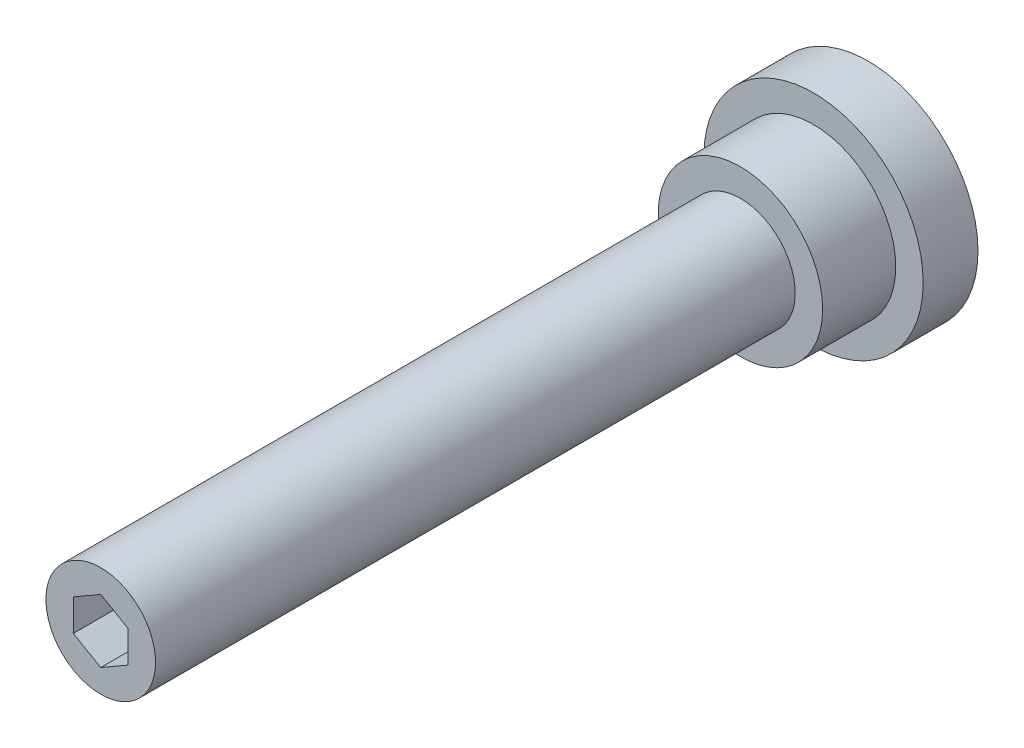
ISO-10303-21;
HEADER;
FILE_DESCRIPTION(('STEP AP214'),'2;1');
FILE_NAME('part.step','',(''),(''),'','','');
FILE_SCHEMA(('AUTOMOTIVE_DESIGN { 1 0 10303 214 1 1 1 1 }'));
ENDSEC;
DATA;
#1=APPLICATION_CONTEXT('core data for automotive mechanical design processes');
#2=APPLICATION_PROTOCOL_DEFINITION('international standard','automotive_design',2000,#1);
#3=PRODUCT_CONTEXT('',#1,'mechanical');
#4=PRODUCT('Part','Part','',(#3));
#5=PRODUCT_RELATED_PRODUCT_CATEGORY('part','',(#4));
#6=PRODUCT_DEFINITION_FORMATION('','',#4);
#7=PRODUCT_DEFINITION_CONTEXT('part definition',#1,'design');
#8=PRODUCT_DEFINITION('design','',#6,#7);
#9=PRODUCT_DEFINITION_SHAPE('','',#8);
#10=(LENGTH_UNIT() NAMED_UNIT(*) SI_UNIT(.MILLI.,.METRE.));
#11=(NAMED_UNIT(*) PLANE_ANGLE_UNIT() SI_UNIT($,.RADIAN.));
#12=(NAMED_UNIT(*) SI_UNIT($,.STERADIAN.) SOLID_ANGLE_UNIT());
#13=UNCERTAINTY_MEASURE_WITH_UNIT(LENGTH_MEASURE(1.E-05),#10,'distance_accuracy_value','');
#14=(GEOMETRIC_REPRESENTATION_CONTEXT(3) GLOBAL_UNCERTAINTY_ASSIGNED_CONTEXT((#13)) GLOBAL_UNIT_ASSIGNED_CONTEXT((#10,
#11,#12)) REPRESENTATION_CONTEXT('',''));
#15=CARTESIAN_POINT('',(0.,0.,0.));
#16=DIRECTION('',(0.,0.,1.));
#17=DIRECTION('',(1.,0.,0.));
#18=AXIS2_PLACEMENT_3D('',#15,#16,#17);
#19=CARTESIAN_POINT('',(0.,0.,42.));
#20=DIRECTION('',(0.,0.,1.));
#21=DIRECTION('',(1.,0.,0.));
#22=AXIS2_PLACEMENT_3D('',#19,#20,#21);
#23=PLANE('',#22);
#24=DIRECTION('',(-0.866025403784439,0.5,0.));
#25=VECTOR('',#24,1.);
#26=CARTESIAN_POINT('',(1.5,0.866025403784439,42.));
#27=LINE('',#26,#25);
#28=CARTESIAN_POINT('',(1.5,0.866025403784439,42.));
#29=VERTEX_POINT('',#28);
#30=CARTESIAN_POINT('',(0.,1.73205080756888,42.));
#31=VERTEX_POINT('',#30);
#32=EDGE_CURVE('E28',#29,#31,#27,.T.);
#33=ORIENTED_EDGE('',*,*,#32,.F.);
#34=DIRECTION('',(0.,1.,0.));
#35=VECTOR('',#34,1.);
#36=CARTESIAN_POINT('',(1.5,-0.866025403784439,42.));
#37=LINE('',#36,#35);
#38=CARTESIAN_POINT('',(1.5,-0.866025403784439,42.));
#39=VERTEX_POINT('',#38);
#40=EDGE_CURVE('E111',#39,#29,#37,.T.);
#41=ORIENTED_EDGE('',*,*,#40,.F.);
#42=DIRECTION('',(0.866025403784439,0.5,0.));
#43=VECTOR('',#42,1.);
#44=CARTESIAN_POINT('',(0.,-1.73205080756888,42.));
#45=LINE('',#44,#43);
#46=CARTESIAN_POINT('',(0.,-1.73205080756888,42.));
#47=VERTEX_POINT('',#46);
#48=EDGE_CURVE('E109',#47,#39,#45,.T.);
#49=ORIENTED_EDGE('',*,*,#48,.F.);
#50=DIRECTION('',(0.866025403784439,-0.5,0.));
#51=VECTOR('',#50,1.);
#52=CARTESIAN_POINT('',(-1.5,-0.866025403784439,42.));
#53=LINE('',#52,#51);
#54=CARTESIAN_POINT('',(-1.5,-0.866025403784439,42.));
#55=VERTEX_POINT('',#54);
#56=EDGE_CURVE('E76',#55,#47,#53,.T.);
#57=ORIENTED_EDGE('',*,*,#56,.F.);
#58=DIRECTION('',(0.,-1.,0.));
#59=VECTOR('',#58,1.);
#60=CARTESIAN_POINT('',(-1.5,0.86602540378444,42.));
#61=LINE('',#60,#59);
#62=CARTESIAN_POINT('',(-1.5,0.86602540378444,42.));
#63=VERTEX_POINT('',#62);
#64=EDGE_CURVE('E105',#63,#55,#61,.T.);
#65=ORIENTED_EDGE('',*,*,#64,.F.);
#66=DIRECTION('',(-0.866025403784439,-0.5,0.));
#67=VECTOR('',#66,1.);
#68=CARTESIAN_POINT('',(0.,1.73205080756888,42.));
#69=LINE('',#68,#67);
#70=EDGE_CURVE('E102',#31,#63,#69,.T.);
#71=ORIENTED_EDGE('',*,*,#70,.F.);
#72=EDGE_LOOP('',(#33,#41,#49,#57,#65,#71));
#73=FACE_BOUND('',#72,.T.);
#74=CARTESIAN_POINT('',(0.,0.,42.));
#75=DIRECTION('',(0.,0.,1.));
#76=DIRECTION('',(1.,0.,0.));
#77=AXIS2_PLACEMENT_3D('',#74,#75,#76);
#78=CIRCLE('',#77,3.);
#79=CARTESIAN_POINT('',(3.,0.,42.));
#80=VERTEX_POINT('',#79);
#81=EDGE_CURVE('E9',#80,#80,#78,.T.);
#82=ORIENTED_EDGE('',*,*,#81,.T.);
#83=EDGE_LOOP('',(#82));
#84=FACE_BOUND('',#83,.T.);
#85=ADVANCED_FACE('F14',(#73,#84),#23,.T.);
#86=CARTESIAN_POINT('',(0.,0.,30.));
#87=DIRECTION('',(0.,0.,1.));
#88=DIRECTION('',(1.,0.,0.));
#89=AXIS2_PLACEMENT_3D('',#86,#87,#88);
#90=CYLINDRICAL_SURFACE('',#89,3.);
#91=CARTESIAN_POINT('',(0.,0.,7.));
#92=DIRECTION('',(0.,0.,1.));
#93=DIRECTION('',(1.,0.,0.));
#94=AXIS2_PLACEMENT_3D('',#91,#92,#93);
#95=CIRCLE('',#94,3.);
#96=CARTESIAN_POINT('',(3.,0.,7.));
#97=VERTEX_POINT('',#96);
#98=EDGE_CURVE('E21',#97,#97,#95,.T.);
#99=ORIENTED_EDGE('',*,*,#98,.T.);
#100=EDGE_LOOP('',(#99));
#101=FACE_BOUND('',#100,.T.);
#102=ORIENTED_EDGE('',*,*,#81,.F.);
#103=EDGE_LOOP('',(#102));
#104=FACE_BOUND('',#103,.T.);
#105=ADVANCED_FACE('F134',(#101,#104),#90,.T.);
#106=CARTESIAN_POINT('',(-3.,0.,7.));
#107=DIRECTION('',(0.,0.,1.));
#108=DIRECTION('',(1.,0.,0.));
#109=AXIS2_PLACEMENT_3D('',#106,#107,#108);
#110=PLANE('',#109);
#111=CARTESIAN_POINT('',(0.,0.,7.));
#112=DIRECTION('',(0.,0.,1.));
#113=DIRECTION('',(1.,0.,0.));
#114=AXIS2_PLACEMENT_3D('',#111,#112,#113);
#115=CIRCLE('',#114,4.5);
#116=CARTESIAN_POINT('',(4.5,0.,7.));
#117=VERTEX_POINT('',#116);
#118=EDGE_CURVE('E129',#117,#117,#115,.T.);
#119=ORIENTED_EDGE('',*,*,#118,.T.);
#120=EDGE_LOOP('',(#119));
#121=FACE_BOUND('',#120,.T.);
#122=ORIENTED_EDGE('',*,*,#98,.F.);
#123=EDGE_LOOP('',(#122));
#124=FACE_BOUND('',#123,.T.);
#125=ADVANCED_FACE('F137',(#121,#124),#110,.T.);
#126=CARTESIAN_POINT('',(0.,0.,30.));
#127=DIRECTION('',(0.,0.,1.));
#128=DIRECTION('',(1.,0.,0.));
#129=AXIS2_PLACEMENT_3D('',#126,#127,#128);
#130=CYLINDRICAL_SURFACE('',#129,4.5);
#131=CARTESIAN_POINT('',(0.,0.,3.));
#132=DIRECTION('',(0.,0.,1.));
#133=DIRECTION('',(1.,0.,0.));
#134=AXIS2_PLACEMENT_3D('',#131,#132,#133);
#135=CIRCLE('',#134,4.5);
#136=CARTESIAN_POINT('',(4.5,0.,3.));
#137=VERTEX_POINT('',#136);
#138=EDGE_CURVE('E126',#137,#137,#135,.T.);
#139=ORIENTED_EDGE('',*,*,#138,.T.);
#140=EDGE_LOOP('',(#139));
#141=FACE_BOUND('',#140,.T.);
#142=ORIENTED_EDGE('',*,*,#118,.F.);
#143=EDGE_LOOP('',(#142));
#144=FACE_BOUND('',#143,.T.);
#145=ADVANCED_FACE('F139',(#141,#144),#130,.T.);
#146=CARTESIAN_POINT('',(-4.5,0.,3.));
#147=DIRECTION('',(0.,0.,1.));
#148=DIRECTION('',(1.,0.,0.));
#149=AXIS2_PLACEMENT_3D('',#146,#147,#148);
#150=PLANE('',#149);
#151=CARTESIAN_POINT('',(0.,0.,3.));
#152=DIRECTION('',(0.,0.,1.));
#153=DIRECTION('',(1.,0.,0.));
#154=AXIS2_PLACEMENT_3D('',#151,#152,#153);
#155=CIRCLE('',#154,6.);
#156=CARTESIAN_POINT('',(6.,0.,3.));
#157=VERTEX_POINT('',#156);
#158=EDGE_CURVE('E123',#157,#157,#155,.T.);
#159=ORIENTED_EDGE('',*,*,#158,.T.);
#160=EDGE_LOOP('',(#159));
#161=FACE_BOUND('',#160,.T.);
#162=ORIENTED_EDGE('',*,*,#138,.F.);
#163=EDGE_LOOP('',(#162));
#164=FACE_BOUND('',#163,.T.);
#165=ADVANCED_FACE('F147',(#161,#164),#150,.T.);
#166=CARTESIAN_POINT('',(0.,0.,30.));
#167=DIRECTION('',(0.,0.,1.));
#168=DIRECTION('',(1.,0.,0.));
#169=AXIS2_PLACEMENT_3D('',#166,#167,#168);
#170=CYLINDRICAL_SURFACE('',#169,6.);
#171=CARTESIAN_POINT('',(0.,0.,0.));
#172=DIRECTION('',(0.,0.,1.));
#173=DIRECTION('',(1.,0.,0.));
#174=AXIS2_PLACEMENT_3D('',#171,#172,#173);
#175=CIRCLE('',#174,6.);
#176=CARTESIAN_POINT('',(6.,0.,0.));
#177=VERTEX_POINT('',#176);
#178=EDGE_CURVE('E115',#177,#177,#175,.T.);
#179=ORIENTED_EDGE('',*,*,#178,.T.);
#180=EDGE_LOOP('',(#179));
#181=FACE_BOUND('',#180,.T.);
#182=ORIENTED_EDGE('',*,*,#158,.F.);
#183=EDGE_LOOP('',(#182));
#184=FACE_BOUND('',#183,.T.);
#185=ADVANCED_FACE('F172',(#181,#184),#170,.T.);
#186=CARTESIAN_POINT('',(-6.,0.,0.));
#187=DIRECTION('',(0.,0.,-1.));
#188=DIRECTION('',(-1.,0.,0.));
#189=AXIS2_PLACEMENT_3D('',#186,#187,#188);
#190=PLANE('',#189);
#191=ORIENTED_EDGE('',*,*,#178,.F.);
#192=EDGE_LOOP('',(#191));
#193=FACE_BOUND('',#192,.T.);
#194=ADVANCED_FACE('F165',(#193),#190,.T.);
#195=CARTESIAN_POINT('',(1.5,0.866025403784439,39.));
#196=DIRECTION('',(0.5,0.866025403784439,0.));
#197=DIRECTION('',(-0.866025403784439,0.5,0.));
#198=AXIS2_PLACEMENT_3D('',#195,#196,#197);
#199=PLANE('',#198);
#200=ORIENTED_EDGE('',*,*,#32,.T.);
#201=DIRECTION('',(0.,0.,1.));
#202=VECTOR('',#201,1.);
#203=CARTESIAN_POINT('',(0.,1.73205080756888,39.));
#204=LINE('',#203,#202);
#205=CARTESIAN_POINT('',(0.,1.73205080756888,39.));
#206=VERTEX_POINT('',#205);
#207=EDGE_CURVE('E58',#206,#31,#204,.T.);
#208=ORIENTED_EDGE('',*,*,#207,.F.);
#209=DIRECTION('',(-0.866025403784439,0.5,0.));
#210=VECTOR('',#209,1.);
#211=CARTESIAN_POINT('',(1.5,0.866025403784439,39.));
#212=LINE('',#211,#210);
#213=CARTESIAN_POINT('',(1.5,0.866025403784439,39.));
#214=VERTEX_POINT('',#213);
#215=EDGE_CURVE('E113',#214,#206,#212,.T.);
#216=ORIENTED_EDGE('',*,*,#215,.F.);
#217=DIRECTION('',(0.,0.,1.));
#218=VECTOR('',#217,1.);
#219=CARTESIAN_POINT('',(1.5,0.866025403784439,39.));
#220=LINE('',#219,#218);
#221=EDGE_CURVE('E36',#214,#29,#220,.T.);
#222=ORIENTED_EDGE('',*,*,#221,.T.);
#223=EDGE_LOOP('',(#200,#208,#216,#222));
#224=FACE_BOUND('',#223,.T.);
#225=ADVANCED_FACE('F162',(#224),#199,.F.);
#226=CARTESIAN_POINT('',(1.5,-0.866025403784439,39.));
#227=DIRECTION('',(1.,0.,0.));
#228=DIRECTION('',(0.,1.,0.));
#229=AXIS2_PLACEMENT_3D('',#226,#227,#228);
#230=PLANE('',#229);
#231=ORIENTED_EDGE('',*,*,#40,.T.);
#232=ORIENTED_EDGE('',*,*,#221,.F.);
#233=DIRECTION('',(0.,1.,0.));
#234=VECTOR('',#233,1.);
#235=CARTESIAN_POINT('',(1.5,-0.866025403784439,39.));
#236=LINE('',#235,#234);
#237=CARTESIAN_POINT('',(1.5,-0.866025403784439,39.));
#238=VERTEX_POINT('',#237);
#239=EDGE_CURVE('E88',#238,#214,#236,.T.);
#240=ORIENTED_EDGE('',*,*,#239,.F.);
#241=DIRECTION('',(0.,0.,1.));
#242=VECTOR('',#241,1.);
#243=CARTESIAN_POINT('',(1.5,-0.866025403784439,39.));
#244=LINE('',#243,#242);
#245=EDGE_CURVE('E80',#238,#39,#244,.T.);
#246=ORIENTED_EDGE('',*,*,#245,.T.);
#247=EDGE_LOOP('',(#231,#232,#240,#246));
#248=FACE_BOUND('',#247,.T.);
#249=ADVANCED_FACE('F164',(#248),#230,.F.);
#250=CARTESIAN_POINT('',(0.,-1.73205080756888,39.));
#251=DIRECTION('',(0.5,-0.866025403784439,0.));
#252=DIRECTION('',(0.866025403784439,0.5,0.));
#253=AXIS2_PLACEMENT_3D('',#250,#251,#252);
#254=PLANE('',#253);
#255=ORIENTED_EDGE('',*,*,#48,.T.);
#256=ORIENTED_EDGE('',*,*,#245,.F.);
#257=DIRECTION('',(0.866025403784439,0.5,0.));
#258=VECTOR('',#257,1.);
#259=CARTESIAN_POINT('',(0.,-1.73205080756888,39.));
#260=LINE('',#259,#258);
#261=CARTESIAN_POINT('',(0.,-1.73205080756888,39.));
#262=VERTEX_POINT('',#261);
#263=EDGE_CURVE('E84',#262,#238,#260,.T.);
#264=ORIENTED_EDGE('',*,*,#263,.F.);
#265=DIRECTION('',(0.,0.,1.));
#266=VECTOR('',#265,1.);
#267=CARTESIAN_POINT('',(0.,-1.73205080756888,39.));
#268=LINE('',#267,#266);
#269=EDGE_CURVE('E69',#262,#47,#268,.T.);
#270=ORIENTED_EDGE('',*,*,#269,.T.);
#271=EDGE_LOOP('',(#255,#256,#264,#270));
#272=FACE_BOUND('',#271,.T.);
#273=ADVANCED_FACE('F85',(#272),#254,.F.);
#274=CARTESIAN_POINT('',(-1.5,-0.866025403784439,39.));
#275=DIRECTION('',(-0.5,-0.866025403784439,0.));
#276=DIRECTION('',(0.866025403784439,-0.5,0.));
#277=AXIS2_PLACEMENT_3D('',#274,#275,#276);
#278=PLANE('',#277);
#279=ORIENTED_EDGE('',*,*,#56,.T.);
#280=ORIENTED_EDGE('',*,*,#269,.F.);
#281=DIRECTION('',(0.866025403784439,-0.5,0.));
#282=VECTOR('',#281,1.);
#283=CARTESIAN_POINT('',(-1.5,-0.866025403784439,39.));
#284=LINE('',#283,#282);
#285=CARTESIAN_POINT('',(-1.5,-0.866025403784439,39.));
#286=VERTEX_POINT('',#285);
#287=EDGE_CURVE('E73',#286,#262,#284,.T.);
#288=ORIENTED_EDGE('',*,*,#287,.F.);
#289=DIRECTION('',(0.,0.,1.));
#290=VECTOR('',#289,1.);
#291=CARTESIAN_POINT('',(-1.5,-0.866025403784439,39.));
#292=LINE('',#291,#290);
#293=EDGE_CURVE('E81',#286,#55,#292,.T.);
#294=ORIENTED_EDGE('',*,*,#293,.T.);
#295=EDGE_LOOP('',(#279,#280,#288,#294));
#296=FACE_BOUND('',#295,.T.);
#297=ADVANCED_FACE('F71',(#296),#278,.F.);
#298=CARTESIAN_POINT('',(-1.5,0.86602540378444,39.));
#299=DIRECTION('',(-1.,0.,0.));
#300=DIRECTION('',(0.,-1.,0.));
#301=AXIS2_PLACEMENT_3D('',#298,#299,#300);
#302=PLANE('',#301);
#303=ORIENTED_EDGE('',*,*,#64,.T.);
#304=ORIENTED_EDGE('',*,*,#293,.F.);
#305=DIRECTION('',(0.,-1.,0.));
#306=VECTOR('',#305,1.);
#307=CARTESIAN_POINT('',(-1.5,0.86602540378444,39.));
#308=LINE('',#307,#306);
#309=CARTESIAN_POINT('',(-1.5,0.86602540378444,39.));
#310=VERTEX_POINT('',#309);
#311=EDGE_CURVE('E94',#310,#286,#308,.T.);
#312=ORIENTED_EDGE('',*,*,#311,.F.);
#313=DIRECTION('',(0.,0.,1.));
#314=VECTOR('',#313,1.);
#315=CARTESIAN_POINT('',(-1.5,0.86602540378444,39.));
#316=LINE('',#315,#314);
#317=EDGE_CURVE('E118',#310,#63,#316,.T.);
#318=ORIENTED_EDGE('',*,*,#317,.T.);
#319=EDGE_LOOP('',(#303,#304,#312,#318));
#320=FACE_BOUND('',#319,.T.);
#321=ADVANCED_FACE('F237',(#320),#302,.F.);
#322=CARTESIAN_POINT('',(0.,1.73205080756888,39.));
#323=DIRECTION('',(-0.5,0.866025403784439,0.));
#324=DIRECTION('',(-0.866025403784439,-0.5,0.));
#325=AXIS2_PLACEMENT_3D('',#322,#323,#324);
#326=PLANE('',#325);
#327=ORIENTED_EDGE('',*,*,#70,.T.);
#328=ORIENTED_EDGE('',*,*,#317,.F.);
#329=DIRECTION('',(-0.866025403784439,-0.5,0.));
#330=VECTOR('',#329,1.);
#331=CARTESIAN_POINT('',(0.,1.73205080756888,39.));
#332=LINE('',#331,#330);
#333=EDGE_CURVE('E96',#206,#310,#332,.T.);
#334=ORIENTED_EDGE('',*,*,#333,.F.);
#335=ORIENTED_EDGE('',*,*,#207,.T.);
#336=EDGE_LOOP('',(#327,#328,#334,#335));
#337=FACE_BOUND('',#336,.T.);
#338=ADVANCED_FACE('F160',(#337),#326,.F.);
#339=CARTESIAN_POINT('',(0.,1.73205080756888,39.));
#340=DIRECTION('',(0.,0.,1.));
#341=DIRECTION('',(1.,0.,0.));
#342=AXIS2_PLACEMENT_3D('',#339,#340,#341);
#343=PLANE('',#342);
#344=ORIENTED_EDGE('',*,*,#215,.T.);
#345=ORIENTED_EDGE('',*,*,#333,.T.);
#346=ORIENTED_EDGE('',*,*,#311,.T.);
#347=ORIENTED_EDGE('',*,*,#287,.T.);
#348=ORIENTED_EDGE('',*,*,#263,.T.);
#349=ORIENTED_EDGE('',*,*,#239,.T.);
#350=EDGE_LOOP('',(#344,#345,#346,#347,#348,#349));
#351=FACE_BOUND('',#350,.T.);
#352=ADVANCED_FACE('F91',(#351),#343,.T.);
#353=CLOSED_SHELL('',(#85,#105,#125,#145,#165,#185,#194,#225,#249,#273,#297,#321,#338,#352));
#354=MANIFOLD_SOLID_BREP('B1',#353);
#355=ADVANCED_BREP_SHAPE_REPRESENTATION('',(#18,#354),#14);
#356=SHAPE_DEFINITION_REPRESENTATION(#9,#355);
ENDSEC;
END-ISO-10303-21;
